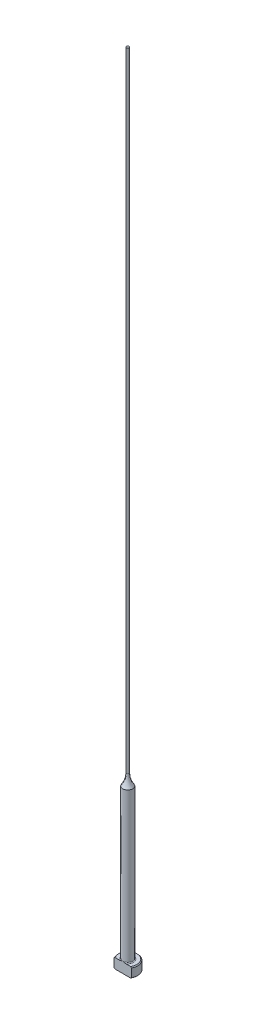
from build123d import *

# Parameters (mm, degrees)
CHAMFER1_SIZE      = 0.254
FILLET1_R          = 0.254
CUT_EXTRUDE1_DEPTH = 255.0396844


with BuildPart() as part:
    # Sketch1 → Revolve1 (revolve)
    with BuildSketch(Plane.XY, mode=Mode.PRIVATE) as revolve1_sk:
        with BuildLine():
            Line((0, 0), (-3.175, 0))
            Line((-3.175, 0), (-3.175, 3.175))
            Line((-3.175, 3.175), (-1.5875, 3.175))
            Line((-1.5875, 3.175), (-1.5875, 50.8))
            ThreePointArc((-1.5875, 50.8), (-0.701386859, 52.557887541), (-0.39624, 54.50268843))
            Line((-0.39624, 54.50268843), (-0.39624, 254))
            Line((-0.39624, 254), (0, 254))
            Line((0, 254), (0, 0))
        make_face()
    revolve(revolve1_sk.sketch.rotate(Axis((0, 259.958771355, 0), (0, -1, 0)), 270), axis=Axis((0, 259.958771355, 0), (0, -1, 0)))

    # Chamfer1
    chamfer1_edges = [part.edges().sort_by_distance(p)[0] for p in [
        (0, 0, -3.175),
        (0, 3.175, -3.175),
    ]]
    chamfer(chamfer1_edges, length=CHAMFER1_SIZE)

    # Fillet1
    fillet1_edges = [part.edges().sort_by_distance(p)[0] for p in [
        (0, 3.175, -1.5875),
    ]]
    fillet(fillet1_edges, radius=FILLET1_R)

    # Sketch2 → Cut-Extrude1 (cut, through all)
    with BuildSketch(Plane.XZ):
        with BuildLine():
            Line((-2.749630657, 1.5875), (2.749630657, 1.5875))
            ThreePointArc((2.749630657, 1.5875), (0, 3.175), (-2.749630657, 1.5875))
        make_face()
    extrude(amount=-CUT_EXTRUDE1_DEPTH, mode=Mode.SUBTRACT)


solid = part.part
